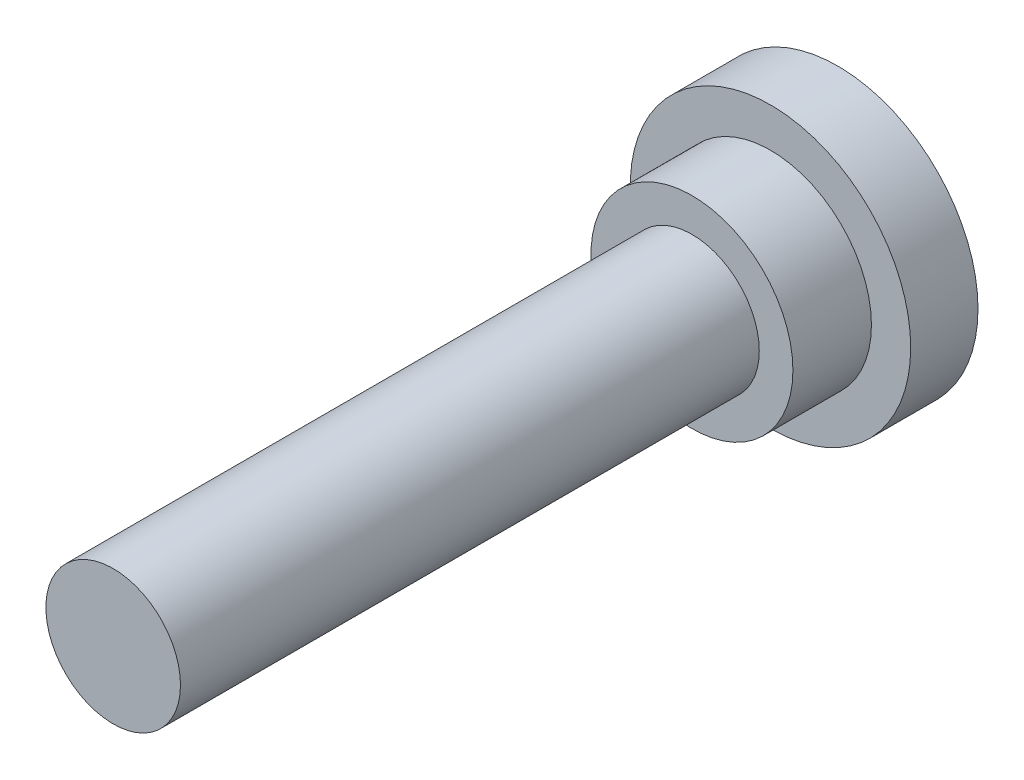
ISO-10303-21;
HEADER;
FILE_DESCRIPTION(('STEP AP214'),'2;1');
FILE_NAME('part.step','',(''),(''),'','','');
FILE_SCHEMA(('AUTOMOTIVE_DESIGN { 1 0 10303 214 1 1 1 1 }'));
ENDSEC;
DATA;
#1=APPLICATION_CONTEXT('core data for automotive mechanical design processes');
#2=APPLICATION_PROTOCOL_DEFINITION('international standard','automotive_design',2000,#1);
#3=PRODUCT_CONTEXT('',#1,'mechanical');
#4=PRODUCT('Part','Part','',(#3));
#5=PRODUCT_RELATED_PRODUCT_CATEGORY('part','',(#4));
#6=PRODUCT_DEFINITION_FORMATION('','',#4);
#7=PRODUCT_DEFINITION_CONTEXT('part definition',#1,'design');
#8=PRODUCT_DEFINITION('design','',#6,#7);
#9=PRODUCT_DEFINITION_SHAPE('','',#8);
#10=(LENGTH_UNIT() NAMED_UNIT(*) SI_UNIT(.MILLI.,.METRE.));
#11=(NAMED_UNIT(*) PLANE_ANGLE_UNIT() SI_UNIT($,.RADIAN.));
#12=(NAMED_UNIT(*) SI_UNIT($,.STERADIAN.) SOLID_ANGLE_UNIT());
#13=UNCERTAINTY_MEASURE_WITH_UNIT(LENGTH_MEASURE(1.E-05),#10,'distance_accuracy_value','');
#14=(GEOMETRIC_REPRESENTATION_CONTEXT(3) GLOBAL_UNCERTAINTY_ASSIGNED_CONTEXT((#13)) GLOBAL_UNIT_ASSIGNED_CONTEXT((#10,
#11,#12)) REPRESENTATION_CONTEXT('',''));
#15=CARTESIAN_POINT('',(0.,0.,0.));
#16=DIRECTION('',(0.,0.,1.));
#17=DIRECTION('',(1.,0.,0.));
#18=AXIS2_PLACEMENT_3D('',#15,#16,#17);
#19=CARTESIAN_POINT('',(0.,0.,64.6));
#20=DIRECTION('',(0.,0.,1.));
#21=DIRECTION('',(1.,0.,0.));
#22=AXIS2_PLACEMENT_3D('',#19,#20,#21);
#23=PLANE('',#22);
#24=CARTESIAN_POINT('',(0.,0.,64.6));
#25=DIRECTION('',(0.,0.,1.));
#26=DIRECTION('',(1.,0.,0.));
#27=AXIS2_PLACEMENT_3D('',#24,#25,#26);
#28=CIRCLE('',#27,6.);
#29=CARTESIAN_POINT('',(6.,0.,64.6));
#30=VERTEX_POINT('',#29);
#31=EDGE_CURVE('E8',#30,#30,#28,.T.);
#32=ORIENTED_EDGE('',*,*,#31,.T.);
#33=EDGE_LOOP('',(#32));
#34=FACE_BOUND('',#33,.T.);
#35=ADVANCED_FACE('F12',(#34),#23,.T.);
#36=CARTESIAN_POINT('',(0.,0.,30.));
#37=DIRECTION('',(0.,0.,1.));
#38=DIRECTION('',(1.,0.,0.));
#39=AXIS2_PLACEMENT_3D('',#36,#37,#38);
#40=CYLINDRICAL_SURFACE('',#39,6.);
#41=CARTESIAN_POINT('',(0.,0.,13.));
#42=DIRECTION('',(0.,0.,1.));
#43=DIRECTION('',(1.,0.,0.));
#44=AXIS2_PLACEMENT_3D('',#41,#42,#43);
#45=CIRCLE('',#44,6.);
#46=CARTESIAN_POINT('',(6.,0.,13.));
#47=VERTEX_POINT('',#46);
#48=EDGE_CURVE('E18',#47,#47,#45,.T.);
#49=ORIENTED_EDGE('',*,*,#48,.T.);
#50=EDGE_LOOP('',(#49));
#51=FACE_BOUND('',#50,.T.);
#52=ORIENTED_EDGE('',*,*,#31,.F.);
#53=EDGE_LOOP('',(#52));
#54=FACE_BOUND('',#53,.T.);
#55=ADVANCED_FACE('F52',(#51,#54),#40,.T.);
#56=CARTESIAN_POINT('',(-6.,0.,13.));
#57=DIRECTION('',(0.,0.,1.));
#58=DIRECTION('',(1.,0.,0.));
#59=AXIS2_PLACEMENT_3D('',#56,#57,#58);
#60=PLANE('',#59);
#61=CARTESIAN_POINT('',(0.,0.,13.));
#62=DIRECTION('',(0.,0.,1.));
#63=DIRECTION('',(1.,0.,0.));
#64=AXIS2_PLACEMENT_3D('',#61,#62,#63);
#65=CIRCLE('',#64,9.);
#66=CARTESIAN_POINT('',(9.,0.,13.));
#67=VERTEX_POINT('',#66);
#68=EDGE_CURVE('E22',#67,#67,#65,.T.);
#69=ORIENTED_EDGE('',*,*,#68,.T.);
#70=EDGE_LOOP('',(#69));
#71=FACE_BOUND('',#70,.T.);
#72=ORIENTED_EDGE('',*,*,#48,.F.);
#73=EDGE_LOOP('',(#72));
#74=FACE_BOUND('',#73,.T.);
#75=ADVANCED_FACE('F57',(#71,#74),#60,.T.);
#76=CARTESIAN_POINT('',(0.,0.,30.));
#77=DIRECTION('',(0.,0.,1.));
#78=DIRECTION('',(1.,0.,0.));
#79=AXIS2_PLACEMENT_3D('',#76,#77,#78);
#80=CYLINDRICAL_SURFACE('',#79,9.);
#81=CARTESIAN_POINT('',(0.,0.,6.));
#82=DIRECTION('',(0.,0.,1.));
#83=DIRECTION('',(1.,0.,0.));
#84=AXIS2_PLACEMENT_3D('',#81,#82,#83);
#85=CIRCLE('',#84,9.);
#86=CARTESIAN_POINT('',(9.,0.,6.));
#87=VERTEX_POINT('',#86);
#88=EDGE_CURVE('E26',#87,#87,#85,.T.);
#89=ORIENTED_EDGE('',*,*,#88,.T.);
#90=EDGE_LOOP('',(#89));
#91=FACE_BOUND('',#90,.T.);
#92=ORIENTED_EDGE('',*,*,#68,.F.);
#93=EDGE_LOOP('',(#92));
#94=FACE_BOUND('',#93,.T.);
#95=ADVANCED_FACE('F62',(#91,#94),#80,.T.);
#96=CARTESIAN_POINT('',(-9.,0.,6.));
#97=DIRECTION('',(0.,0.,1.));
#98=DIRECTION('',(1.,0.,0.));
#99=AXIS2_PLACEMENT_3D('',#96,#97,#98);
#100=PLANE('',#99);
#101=CARTESIAN_POINT('',(0.,0.,6.));
#102=DIRECTION('',(0.,0.,1.));
#103=DIRECTION('',(1.,0.,0.));
#104=AXIS2_PLACEMENT_3D('',#101,#102,#103);
#105=CIRCLE('',#104,12.5);
#106=CARTESIAN_POINT('',(12.5,0.,6.));
#107=VERTEX_POINT('',#106);
#108=EDGE_CURVE('E31',#107,#107,#105,.T.);
#109=ORIENTED_EDGE('',*,*,#108,.T.);
#110=EDGE_LOOP('',(#109));
#111=FACE_BOUND('',#110,.T.);
#112=ORIENTED_EDGE('',*,*,#88,.F.);
#113=EDGE_LOOP('',(#112));
#114=FACE_BOUND('',#113,.T.);
#115=ADVANCED_FACE('F49',(#111,#114),#100,.T.);
#116=CARTESIAN_POINT('',(0.,0.,30.));
#117=DIRECTION('',(0.,0.,1.));
#118=DIRECTION('',(1.,0.,0.));
#119=AXIS2_PLACEMENT_3D('',#116,#117,#118);
#120=CYLINDRICAL_SURFACE('',#119,12.5);
#121=CARTESIAN_POINT('',(0.,0.,0.));
#122=DIRECTION('',(0.,0.,1.));
#123=DIRECTION('',(1.,0.,0.));
#124=AXIS2_PLACEMENT_3D('',#121,#122,#123);
#125=CIRCLE('',#124,12.5);
#126=CARTESIAN_POINT('',(12.5,0.,0.));
#127=VERTEX_POINT('',#126);
#128=EDGE_CURVE('E34',#127,#127,#125,.T.);
#129=ORIENTED_EDGE('',*,*,#128,.T.);
#130=EDGE_LOOP('',(#129));
#131=FACE_BOUND('',#130,.T.);
#132=ORIENTED_EDGE('',*,*,#108,.F.);
#133=EDGE_LOOP('',(#132));
#134=FACE_BOUND('',#133,.T.);
#135=ADVANCED_FACE('F38',(#131,#134),#120,.T.);
#136=CARTESIAN_POINT('',(-12.5,0.,0.));
#137=DIRECTION('',(0.,0.,-1.));
#138=DIRECTION('',(-1.,0.,0.));
#139=AXIS2_PLACEMENT_3D('',#136,#137,#138);
#140=PLANE('',#139);
#141=ORIENTED_EDGE('',*,*,#128,.F.);
#142=EDGE_LOOP('',(#141));
#143=FACE_BOUND('',#142,.T.);
#144=ADVANCED_FACE('F41',(#143),#140,.T.);
#145=CLOSED_SHELL('',(#35,#55,#75,#95,#115,#135,#144));
#146=MANIFOLD_SOLID_BREP('B1',#145);
#147=ADVANCED_BREP_SHAPE_REPRESENTATION('',(#18,#146),#14);
#148=SHAPE_DEFINITION_REPRESENTATION(#9,#147);
ENDSEC;
END-ISO-10303-21;
